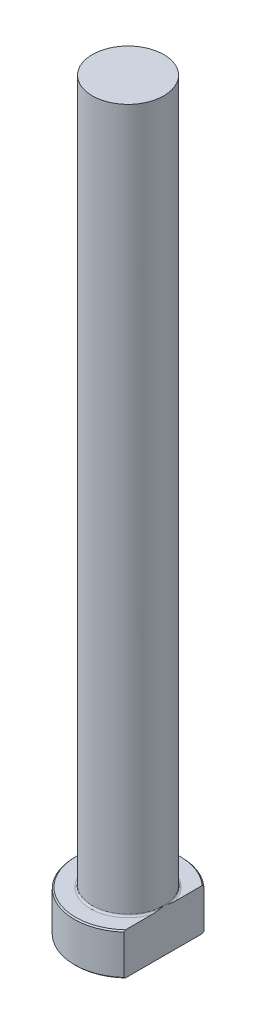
ISO-10303-21;
HEADER;
FILE_DESCRIPTION(('STEP AP214'),'2;1');
FILE_NAME('part.step','',(''),(''),'','','');
FILE_SCHEMA(('AUTOMOTIVE_DESIGN { 1 0 10303 214 1 1 1 1 }'));
ENDSEC;
DATA;
#1=APPLICATION_CONTEXT('core data for automotive mechanical design processes');
#2=APPLICATION_PROTOCOL_DEFINITION('international standard','automotive_design',2000,#1);
#3=PRODUCT_CONTEXT('',#1,'mechanical');
#4=PRODUCT('Part','Part','',(#3));
#5=PRODUCT_RELATED_PRODUCT_CATEGORY('part','',(#4));
#6=PRODUCT_DEFINITION_FORMATION('','',#4);
#7=PRODUCT_DEFINITION_CONTEXT('part definition',#1,'design');
#8=PRODUCT_DEFINITION('design','',#6,#7);
#9=PRODUCT_DEFINITION_SHAPE('','',#8);
#10=(LENGTH_UNIT() NAMED_UNIT(*) SI_UNIT(.MILLI.,.METRE.));
#11=(NAMED_UNIT(*) PLANE_ANGLE_UNIT() SI_UNIT($,.RADIAN.));
#12=(NAMED_UNIT(*) SI_UNIT($,.STERADIAN.) SOLID_ANGLE_UNIT());
#13=UNCERTAINTY_MEASURE_WITH_UNIT(LENGTH_MEASURE(1.E-05),#10,'distance_accuracy_value','');
#14=(GEOMETRIC_REPRESENTATION_CONTEXT(3) GLOBAL_UNCERTAINTY_ASSIGNED_CONTEXT((#13)) GLOBAL_UNIT_ASSIGNED_CONTEXT((#10,
#11,#12)) REPRESENTATION_CONTEXT('',''));
#15=CARTESIAN_POINT('',(0.,0.,0.));
#16=DIRECTION('',(0.,0.,1.));
#17=DIRECTION('',(1.,0.,0.));
#18=AXIS2_PLACEMENT_3D('',#15,#16,#17);
#19=CARTESIAN_POINT('',(0.,0.,0.));
#20=DIRECTION('',(0.,-1.,0.));
#21=DIRECTION('',(0.,0.,-1.));
#22=AXIS2_PLACEMENT_3D('',#19,#20,#21);
#23=PLANE('',#22);
#24=CARTESIAN_POINT('',(0.,0.,0.));
#25=DIRECTION('',(0.,-1.,0.));
#26=DIRECTION('',(0.,0.,-1.));
#27=AXIS2_PLACEMENT_3D('',#24,#25,#26);
#28=CIRCLE('',#27,8.79999999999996);
#29=CARTESIAN_POINT('',(5.99999999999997,0.,6.4373907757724));
#30=VERTEX_POINT('',#29);
#31=CARTESIAN_POINT('',(5.99999999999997,0.,-6.4373907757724));
#32=VERTEX_POINT('',#31);
#33=EDGE_CURVE('E98',#30,#32,#28,.T.);
#34=ORIENTED_EDGE('',*,*,#33,.T.);
#35=DIRECTION('',(0.,0.,1.));
#36=VECTOR('',#35,1.);
#37=CARTESIAN_POINT('',(5.99999999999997,0.,-6.70820393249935));
#38=LINE('',#37,#36);
#39=EDGE_CURVE('E83',#32,#30,#38,.T.);
#40=ORIENTED_EDGE('',*,*,#39,.T.);
#41=EDGE_LOOP('',(#34,#40));
#42=FACE_BOUND('',#41,.T.);
#43=ADVANCED_FACE('F32',(#42),#23,.T.);
#44=CARTESIAN_POINT('',(0.,259.958771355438,0.));
#45=DIRECTION('',(0.,1.,0.));
#46=DIRECTION('',(0.,0.,1.));
#47=AXIS2_PLACEMENT_3D('',#44,#45,#46);
#48=CYLINDRICAL_SURFACE('',#47,8.99999999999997);
#49=CARTESIAN_POINT('',(0.,6.79999999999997,0.));
#50=DIRECTION('',(0.,1.,0.));
#51=DIRECTION('',(0.,0.,1.));
#52=AXIS2_PLACEMENT_3D('',#49,#50,#51);
#53=CIRCLE('',#52,8.99999999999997);
#54=CARTESIAN_POINT('',(5.99999999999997,6.79999999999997,6.70820393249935));
#55=VERTEX_POINT('',#54);
#56=CARTESIAN_POINT('',(5.99999999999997,6.79999999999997,-6.70820393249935));
#57=VERTEX_POINT('',#56);
#58=EDGE_CURVE('E104',#55,#57,#53,.F.);
#59=ORIENTED_EDGE('',*,*,#58,.T.);
#60=DIRECTION('',(0.,-1.,0.));
#61=VECTOR('',#60,1.);
#62=CARTESIAN_POINT('',(5.99999999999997,125.,-6.70820393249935));
#63=LINE('',#62,#61);
#64=CARTESIAN_POINT('',(5.99999999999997,0.199999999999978,-6.70820393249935));
#65=VERTEX_POINT('',#64);
#66=EDGE_CURVE('E183',#57,#65,#63,.T.);
#67=ORIENTED_EDGE('',*,*,#66,.T.);
#68=CARTESIAN_POINT('',(0.,0.199999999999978,0.));
#69=DIRECTION('',(0.,-1.,0.));
#70=DIRECTION('',(0.,0.,-1.));
#71=AXIS2_PLACEMENT_3D('',#68,#69,#70);
#72=CIRCLE('',#71,8.99999999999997);
#73=CARTESIAN_POINT('',(5.99999999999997,0.199999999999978,6.70820393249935));
#74=VERTEX_POINT('',#73);
#75=EDGE_CURVE('E100',#65,#74,#72,.F.);
#76=ORIENTED_EDGE('',*,*,#75,.T.);
#77=DIRECTION('',(0.,-1.,0.));
#78=VECTOR('',#77,1.);
#79=CARTESIAN_POINT('',(5.99999999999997,125.,6.70820393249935));
#80=LINE('',#79,#78);
#81=EDGE_CURVE('E93',#55,#74,#80,.T.);
#82=ORIENTED_EDGE('',*,*,#81,.F.);
#83=EDGE_LOOP('',(#59,#67,#76,#82));
#84=FACE_BOUND('',#83,.T.);
#85=ADVANCED_FACE('F158',(#84),#48,.T.);
#86=CARTESIAN_POINT('',(-8.99999999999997,7.,0.));
#87=DIRECTION('',(0.,1.,0.));
#88=DIRECTION('',(0.,0.,1.));
#89=AXIS2_PLACEMENT_3D('',#86,#87,#88);
#90=PLANE('',#89);
#91=CARTESIAN_POINT('',(0.,7.,0.));
#92=DIRECTION('',(0.,1.,0.));
#93=DIRECTION('',(0.,0.,1.));
#94=AXIS2_PLACEMENT_3D('',#91,#92,#93);
#95=CIRCLE('',#94,8.79999999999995);
#96=CARTESIAN_POINT('',(5.99999999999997,7.,-6.4373907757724));
#97=VERTEX_POINT('',#96);
#98=CARTESIAN_POINT('',(5.99999999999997,7.,6.4373907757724));
#99=VERTEX_POINT('',#98);
#100=EDGE_CURVE('E178',#97,#99,#95,.T.);
#101=ORIENTED_EDGE('',*,*,#100,.T.);
#102=DIRECTION('',(0.,0.,-1.));
#103=VECTOR('',#102,1.);
#104=CARTESIAN_POINT('',(5.99999999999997,7.,0.));
#105=LINE('',#104,#103);
#106=CARTESIAN_POINT('',(5.99999999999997,6.99999999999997,1.92093727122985));
#107=VERTEX_POINT('',#106);
#108=EDGE_CURVE('E57',#99,#107,#105,.T.);
#109=ORIENTED_EDGE('',*,*,#108,.T.);
#110=CARTESIAN_POINT('',(0.,7.,0.));
#111=DIRECTION('',(0.,1.,0.));
#112=DIRECTION('',(0.,0.,1.));
#113=AXIS2_PLACEMENT_3D('',#110,#111,#112);
#114=CIRCLE('',#113,6.29999999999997);
#115=CARTESIAN_POINT('',(5.99999999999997,6.99999999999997,-1.92093727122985));
#116=VERTEX_POINT('',#115);
#117=EDGE_CURVE('E107',#107,#116,#114,.F.);
#118=ORIENTED_EDGE('',*,*,#117,.T.);
#119=EDGE_CURVE('E136',#116,#97,#105,.T.);
#120=ORIENTED_EDGE('',*,*,#119,.T.);
#121=EDGE_LOOP('',(#101,#109,#118,#120));
#122=FACE_BOUND('',#121,.T.);
#123=ADVANCED_FACE('F147',(#122),#90,.T.);
#124=CARTESIAN_POINT('',(0.,7.00000000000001,0.));
#125=DIRECTION('',(0.,-1.,0.));
#126=DIRECTION('',(0.,0.,-1.));
#127=AXIS2_PLACEMENT_3D('',#124,#125,#126);
#128=CONICAL_SURFACE('',#127,8.79999999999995,0.785398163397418);
#129=ORIENTED_EDGE('',*,*,#58,.F.);
#130=CARTESIAN_POINT('',(5.99999999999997,-0.132115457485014,14.7591430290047));
#131=CARTESIAN_POINT('',(5.99999999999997,0.0733919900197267,14.537299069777));
#132=CARTESIAN_POINT('',(5.99999999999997,0.278550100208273,14.315131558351));
#133=CARTESIAN_POINT('',(5.99999999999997,0.688060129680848,13.8700519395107));
#134=CARTESIAN_POINT('',(5.99999999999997,0.892412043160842,13.6471398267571));
#135=CARTESIAN_POINT('',(5.99999999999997,1.50418032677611,12.9770492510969));
#136=CARTESIAN_POINT('',(5.99999999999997,1.91022091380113,12.528611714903));
#137=CARTESIAN_POINT('',(5.99999999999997,2.71980134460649,11.6246427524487));
#138=CARTESIAN_POINT('',(5.99999999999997,3.12331180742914,11.1690849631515));
#139=CARTESIAN_POINT('',(5.99999999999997,3.92341525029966,10.2520077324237));
#140=CARTESIAN_POINT('',(5.99999999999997,4.32000903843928,9.79048899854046));
#141=CARTESIAN_POINT('',(5.99999999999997,5.02478816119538,8.95241885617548));
#142=CARTESIAN_POINT('',(5.99999999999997,5.33476112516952,8.57737771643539));
#143=CARTESIAN_POINT('',(5.99999999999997,5.79310598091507,8.00939108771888));
#144=CARTESIAN_POINT('',(5.99999999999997,5.9448056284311,7.81913145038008));
#145=CARTESIAN_POINT('',(5.99999999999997,6.24553651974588,7.43651727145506));
#146=CARTESIAN_POINT('',(5.99999999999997,6.39456781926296,7.24416277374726));
#147=CARTESIAN_POINT('',(5.99999999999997,6.68925367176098,6.85721540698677));
#148=CARTESIAN_POINT('',(5.99999999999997,6.83491177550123,6.66262524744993));
#149=CARTESIAN_POINT('',(5.99999999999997,7.12230719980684,6.27057707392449));
#150=CARTESIAN_POINT('',(5.99999999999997,7.26404470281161,6.07311919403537));
#151=CARTESIAN_POINT('',(5.99999999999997,7.54263362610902,5.6748871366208));
#152=CARTESIAN_POINT('',(5.99999999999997,7.67948689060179,5.47411425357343));
#153=CARTESIAN_POINT('',(5.99999999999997,7.94714213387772,5.06858845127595));
#154=CARTESIAN_POINT('',(5.99999999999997,8.07794479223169,4.86383598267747));
#155=CARTESIAN_POINT('',(5.99999999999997,8.32827993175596,4.45554322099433));
#156=CARTESIAN_POINT('',(5.99999999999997,8.448027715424,4.25213564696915));
#157=CARTESIAN_POINT('',(5.99999999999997,8.67837972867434,3.84013730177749));
#158=CARTESIAN_POINT('',(5.99999999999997,8.78898293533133,3.63154595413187));
#159=CARTESIAN_POINT('',(5.99999999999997,8.99840984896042,3.20863811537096));
#160=CARTESIAN_POINT('',(5.99999999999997,9.09724073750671,2.99432521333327));
#161=CARTESIAN_POINT('',(5.99999999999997,9.2799177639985,2.55937061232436));
#162=CARTESIAN_POINT('',(5.99999999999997,9.36376811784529,2.33873071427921));
#163=CARTESIAN_POINT('',(5.99999999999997,9.49627737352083,1.94012294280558));
#164=CARTESIAN_POINT('',(5.99999999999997,9.5486217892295,1.76338731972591));
#165=CARTESIAN_POINT('',(5.99999999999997,9.639780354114,1.40643307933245));
#166=CARTESIAN_POINT('',(5.99999999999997,9.67859618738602,1.22621489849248));
#167=CARTESIAN_POINT('',(5.99999999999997,9.74077317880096,0.863704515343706));
#168=CARTESIAN_POINT('',(5.99999999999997,9.76418479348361,0.681421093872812));
#169=CARTESIAN_POINT('',(5.99999999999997,9.79447814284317,0.315473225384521));
#170=CARTESIAN_POINT('',(5.99999999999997,9.80136083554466,0.131808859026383));
#171=CARTESIAN_POINT('',(5.99999999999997,9.79818788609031,-0.235881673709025));
#172=CARTESIAN_POINT('',(5.99999999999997,9.78808514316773,-0.419907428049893));
#173=CARTESIAN_POINT('',(5.99999999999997,9.75144464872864,-0.786302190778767));
#174=CARTESIAN_POINT('',(5.99999999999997,9.72490559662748,-0.968671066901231));
#175=CARTESIAN_POINT('',(5.99999999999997,9.65670736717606,-1.33110767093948));
#176=CARTESIAN_POINT('',(5.99999999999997,9.61500120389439,-1.51116642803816));
#177=CARTESIAN_POINT('',(5.99999999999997,9.51838325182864,-1.86766519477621));
#178=CARTESIAN_POINT('',(5.99999999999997,9.46347085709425,-2.04410503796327));
#179=CARTESIAN_POINT('',(5.99999999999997,9.33563659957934,-2.41270922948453));
#180=CARTESIAN_POINT('',(5.99999999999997,9.26138327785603,-2.60440790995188));
#181=CARTESIAN_POINT('',(5.99999999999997,9.10155310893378,-2.98306496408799));
#182=CARTESIAN_POINT('',(5.99999999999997,9.01597146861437,-3.17002129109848));
#183=CARTESIAN_POINT('',(5.99999999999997,8.83553473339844,-3.53975380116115));
#184=CARTESIAN_POINT('',(5.99999999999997,8.74066449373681,-3.72252253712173));
#185=CARTESIAN_POINT('',(5.99999999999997,8.5435547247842,-4.08398624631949));
#186=CARTESIAN_POINT('',(5.99999999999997,8.44131612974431,-4.26268173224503));
#187=CARTESIAN_POINT('',(5.99999999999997,8.22953960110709,-4.61872309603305));
#188=CARTESIAN_POINT('',(5.99999999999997,8.11992610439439,-4.79602381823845));
#189=CARTESIAN_POINT('',(5.99999999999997,7.89571048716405,-5.14743548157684));
#190=CARTESIAN_POINT('',(5.99999999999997,7.78110825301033,-5.32154634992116));
#191=CARTESIAN_POINT('',(5.99999999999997,7.54792782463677,-5.66682327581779));
#192=CARTESIAN_POINT('',(5.99999999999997,7.42935372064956,-5.83799210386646));
#193=CARTESIAN_POINT('',(5.99999999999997,7.18881616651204,-6.17793707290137));
#194=CARTESIAN_POINT('',(5.99999999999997,7.06685256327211,-6.34671310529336));
#195=CARTESIAN_POINT('',(5.99999999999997,6.8053977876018,-6.70216781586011));
#196=CARTESIAN_POINT('',(5.99999999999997,6.66554966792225,-6.88858356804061));
#197=CARTESIAN_POINT('',(5.99999999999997,6.38292065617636,-7.25918139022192));
#198=CARTESIAN_POINT('',(5.99999999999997,6.24013967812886,-7.44336339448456));
#199=CARTESIAN_POINT('',(5.99999999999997,5.80812002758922,-7.99307414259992));
#200=CARTESIAN_POINT('',(5.99999999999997,5.51523002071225,-8.35573349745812));
#201=CARTESIAN_POINT('',(5.99999999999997,4.92224619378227,-9.07562940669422));
#202=CARTESIAN_POINT('',(5.99999999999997,4.62214609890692,-9.43286076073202));
#203=CARTESIAN_POINT('',(5.99999999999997,4.0167738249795,-10.1429201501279));
#204=CARTESIAN_POINT('',(5.99999999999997,3.71150152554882,-10.4957480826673));
#205=CARTESIAN_POINT('',(5.99999999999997,3.11456796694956,-11.1779164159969));
#206=CARTESIAN_POINT('',(5.99999999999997,2.82312451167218,-11.5074478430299));
#207=CARTESIAN_POINT('',(5.99999999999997,2.23747184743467,-12.1640528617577));
#208=CARTESIAN_POINT('',(5.99999999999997,1.94326258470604,-12.4911264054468));
#209=CARTESIAN_POINT('',(5.99999999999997,1.35320776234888,-13.1426363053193));
#210=CARTESIAN_POINT('',(5.99999999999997,1.05736649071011,-13.4670765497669));
#211=CARTESIAN_POINT('',(5.99999999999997,0.463882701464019,-14.1142803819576));
#212=CARTESIAN_POINT('',(5.99999999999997,0.166240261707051,-14.4370440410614));
#213=CARTESIAN_POINT('',(5.99999999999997,-0.132115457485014,-14.7591430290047));
#214=B_SPLINE_CURVE_WITH_KNOTS('',3,(#130,#131,#132,#133,#134,#135,#136,#137,#138,#139,#140,
#141,#142,#143,#144,#145,#146,#147,#148,#149,#150,#151,#152,#153,#154,#155,#156,#157,#158,#159,
#160,#161,#162,#163,#164,#165,#166,#167,#168,#169,#170,#171,#172,#173,#174,#175,#176,#177,#178,
#179,#180,#181,#182,#183,#184,#185,#186,#187,#188,#189,#190,#191,#192,#193,#194,#195,#196,#197,
#198,#199,#200,#201,#202,#203,#204,#205,#206,#207,#208,#209,#210,#211,#212,#213),.UNSPECIFIED.,
.F.,.F.,(4,2,2,2,2,2,2,2,2,2,2,2,2,2,2,2,2,2,2,2,2,2,2,2,2,2,2,2,2,2,2,2,2,2,2,2,2,2,2,2,2,4),
(0.,0.907210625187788,1.81442776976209,3.62925156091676,5.4549048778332,7.28034345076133,
8.73990838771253,9.46989218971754,10.1998607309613,10.9290223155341,11.6581499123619,
12.3869992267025,13.1157664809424,13.82369738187,14.5317073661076,15.2392832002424,
15.9466595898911,16.4991819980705,17.0516356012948,17.6022705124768,18.1528735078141,
18.7050058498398,19.2571818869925,19.8110832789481,20.365010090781,20.9812908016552,
21.5978331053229,22.2153979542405,22.8328846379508,23.4581285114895,24.083386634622,
24.7080195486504,25.3326807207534,26.0317691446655,26.7308780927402,28.1292235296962,
29.5288334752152,30.9284760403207,32.2482200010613,33.5679896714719,34.8851960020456,
36.2023458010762),.UNSPECIFIED.);
#215=EDGE_CURVE('E135',#55,#99,#214,.T.);
#216=ORIENTED_EDGE('',*,*,#215,.T.);
#217=ORIENTED_EDGE('',*,*,#100,.F.);
#218=EDGE_CURVE('E127',#97,#57,#214,.T.);
#219=ORIENTED_EDGE('',*,*,#218,.T.);
#220=EDGE_LOOP('',(#129,#216,#217,#219));
#221=FACE_BOUND('',#220,.T.);
#222=ADVANCED_FACE('F143',(#221),#128,.T.);
#223=CARTESIAN_POINT('',(0.,0.199999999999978,0.));
#224=DIRECTION('',(0.,1.,0.));
#225=DIRECTION('',(0.,0.,1.));
#226=AXIS2_PLACEMENT_3D('',#223,#224,#225);
#227=CONICAL_SURFACE('',#226,8.99999999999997,0.785398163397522);
#228=ORIENTED_EDGE('',*,*,#75,.F.);
#229=CARTESIAN_POINT('',(5.99999999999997,7.13211545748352,-14.7591430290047));
#230=CARTESIAN_POINT('',(5.99999999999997,6.9266080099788,-14.537299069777));
#231=CARTESIAN_POINT('',(5.99999999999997,6.72144989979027,-14.3151315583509));
#232=CARTESIAN_POINT('',(5.99999999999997,6.31193987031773,-13.8700519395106));
#233=CARTESIAN_POINT('',(5.99999999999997,6.10758795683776,-13.647139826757));
#234=CARTESIAN_POINT('',(5.99999999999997,5.49581967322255,-12.9770492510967));
#235=CARTESIAN_POINT('',(5.99999999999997,5.08977908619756,-12.5286117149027));
#236=CARTESIAN_POINT('',(5.99999999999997,4.28019865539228,-11.6246427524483));
#237=CARTESIAN_POINT('',(5.99999999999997,3.87668819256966,-11.1690849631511));
#238=CARTESIAN_POINT('',(5.99999999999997,3.0765847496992,-10.2520077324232));
#239=CARTESIAN_POINT('',(5.99999999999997,2.67999096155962,-9.79048899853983));
#240=CARTESIAN_POINT('',(5.99999999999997,1.97521183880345,-8.95241885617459));
#241=CARTESIAN_POINT('',(5.99999999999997,1.66523887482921,-8.5773777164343));
#242=CARTESIAN_POINT('',(5.99999999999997,1.20689401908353,-8.00939108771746));
#243=CARTESIAN_POINT('',(5.99999999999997,1.05519437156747,-7.81913145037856));
#244=CARTESIAN_POINT('',(5.99999999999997,0.754463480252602,-7.43651727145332));
#245=CARTESIAN_POINT('',(5.99999999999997,0.605432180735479,-7.2441627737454));
#246=CARTESIAN_POINT('',(5.99999999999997,0.310746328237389,-6.8572154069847));
#247=CARTESIAN_POINT('',(5.99999999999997,0.1650882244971,-6.66262524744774));
#248=CARTESIAN_POINT('',(5.99999999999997,-0.122307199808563,-6.27057707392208));
#249=CARTESIAN_POINT('',(5.99999999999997,-0.264044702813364,-6.07311919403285));
#250=CARTESIAN_POINT('',(5.99999999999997,-0.542633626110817,-5.67488713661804));
#251=CARTESIAN_POINT('',(5.99999999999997,-0.679486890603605,-5.47411425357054));
#252=CARTESIAN_POINT('',(5.99999999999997,-0.947142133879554,-5.06858845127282));
#253=CARTESIAN_POINT('',(5.99999999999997,-1.07794479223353,-4.86383598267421));
#254=CARTESIAN_POINT('',(5.99999999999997,-1.32827993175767,-4.45554322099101));
#255=CARTESIAN_POINT('',(5.99999999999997,-1.44802771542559,-4.25213564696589));
#256=CARTESIAN_POINT('',(5.99999999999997,-1.67837972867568,-3.84013730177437));
#257=CARTESIAN_POINT('',(5.99999999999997,-1.78898293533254,-3.63154595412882));
#258=CARTESIAN_POINT('',(5.99999999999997,-1.99840984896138,-3.20863811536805));
#259=CARTESIAN_POINT('',(5.99999999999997,-2.09724073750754,-2.99432521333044));
#260=CARTESIAN_POINT('',(5.99999999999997,-2.27991776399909,-2.55937061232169));
#261=CARTESIAN_POINT('',(5.99999999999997,-2.36376811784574,-2.33873071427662));
#262=CARTESIAN_POINT('',(5.99999999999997,-2.4962773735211,-1.94012294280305));
#263=CARTESIAN_POINT('',(5.99999999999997,-2.5486217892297,-1.76338731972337));
#264=CARTESIAN_POINT('',(5.99999999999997,-2.63978035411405,-1.40643307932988));
#265=CARTESIAN_POINT('',(5.99999999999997,-2.67859618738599,-1.2262148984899));
#266=CARTESIAN_POINT('',(5.99999999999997,-2.74077317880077,-0.863704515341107));
#267=CARTESIAN_POINT('',(5.99999999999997,-2.76418479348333,-0.681421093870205));
#268=CARTESIAN_POINT('',(5.99999999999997,-2.79447814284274,-0.315473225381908));
#269=CARTESIAN_POINT('',(5.99999999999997,-2.80136083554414,-0.131808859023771));
#270=CARTESIAN_POINT('',(5.99999999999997,-2.79818788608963,0.235881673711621));
#271=CARTESIAN_POINT('',(5.99999999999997,-2.78808514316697,0.419907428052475));
#272=CARTESIAN_POINT('',(5.99999999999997,-2.75144464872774,0.786302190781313));
#273=CARTESIAN_POINT('',(5.99999999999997,-2.72490559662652,0.968671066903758));
#274=CARTESIAN_POINT('',(5.99999999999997,-2.65670736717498,1.33110767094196));
#275=CARTESIAN_POINT('',(5.99999999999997,-2.61500120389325,1.51116642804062));
#276=CARTESIAN_POINT('',(5.99999999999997,-2.51838325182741,1.86766519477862));
#277=CARTESIAN_POINT('',(5.99999999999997,-2.46347085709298,2.04410503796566));
#278=CARTESIAN_POINT('',(5.99999999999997,-2.33563659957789,2.41270922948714));
#279=CARTESIAN_POINT('',(5.99999999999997,-2.26138327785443,2.60440790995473));
#280=CARTESIAN_POINT('',(5.99999999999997,-2.10155310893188,2.98306496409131));
#281=CARTESIAN_POINT('',(5.99999999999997,-2.0159714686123,3.17002129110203));
#282=CARTESIAN_POINT('',(5.99999999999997,-1.83553473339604,3.53975380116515));
#283=CARTESIAN_POINT('',(5.99999999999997,-1.74066449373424,3.72252253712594));
#284=CARTESIAN_POINT('',(5.99999999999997,-1.54355472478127,4.08398624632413));
#285=CARTESIAN_POINT('',(5.99999999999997,-1.4413161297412,4.26268173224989));
#286=CARTESIAN_POINT('',(5.99999999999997,-1.22953960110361,4.61872309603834));
#287=CARTESIAN_POINT('',(5.99999999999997,-1.11992610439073,4.79602381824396));
#288=CARTESIAN_POINT('',(5.99999999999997,-0.89571048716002,5.14743548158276));
#289=CARTESIAN_POINT('',(5.99999999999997,-0.781108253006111,5.32154634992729));
#290=CARTESIAN_POINT('',(5.99999999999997,-0.547927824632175,5.66682327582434));
#291=CARTESIAN_POINT('',(5.99999999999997,-0.429353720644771,5.83799210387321));
#292=CARTESIAN_POINT('',(5.99999999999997,-0.188816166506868,6.17793707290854));
#293=CARTESIAN_POINT('',(5.99999999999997,-0.0668525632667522,6.34671310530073));
#294=CARTESIAN_POINT('',(5.99999999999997,0.194602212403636,6.70216781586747));
#295=CARTESIAN_POINT('',(5.99999999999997,0.334450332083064,6.88858356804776));
#296=CARTESIAN_POINT('',(5.99999999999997,0.617079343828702,7.25918139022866));
#297=CARTESIAN_POINT('',(5.99999999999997,0.759860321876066,7.4433633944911));
#298=CARTESIAN_POINT('',(5.99999999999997,1.19187997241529,7.99307414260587));
#299=CARTESIAN_POINT('',(5.99999999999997,1.48476997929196,8.35573349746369));
#300=CARTESIAN_POINT('',(5.99999999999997,2.07775380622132,9.07562940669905));
#301=CARTESIAN_POINT('',(5.99999999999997,2.37785390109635,9.43286076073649));
#302=CARTESIAN_POINT('',(5.99999999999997,2.98322617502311,10.1429201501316));
#303=CARTESIAN_POINT('',(5.99999999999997,3.28849847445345,10.4957480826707));
#304=CARTESIAN_POINT('',(5.99999999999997,3.8854320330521,11.1779164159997));
#305=CARTESIAN_POINT('',(5.99999999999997,4.1768754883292,11.5074478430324));
#306=CARTESIAN_POINT('',(5.99999999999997,4.76252815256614,12.1640528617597));
#307=CARTESIAN_POINT('',(5.99999999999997,5.05673741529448,12.4911264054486));
#308=CARTESIAN_POINT('',(5.99999999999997,5.64679223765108,13.1426363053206));
#309=CARTESIAN_POINT('',(5.99999999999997,5.94263350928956,13.4670765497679));
#310=CARTESIAN_POINT('',(5.99999999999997,6.53611729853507,14.1142803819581));
#311=CARTESIAN_POINT('',(5.99999999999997,6.83375973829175,14.4370440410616));
#312=CARTESIAN_POINT('',(5.99999999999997,7.13211545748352,14.7591430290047));
#313=B_SPLINE_CURVE_WITH_KNOTS('',3,(#229,#230,#231,#232,#233,#234,#235,#236,#237,#238,#239,
#240,#241,#242,#243,#244,#245,#246,#247,#248,#249,#250,#251,#252,#253,#254,#255,#256,#257,#258,
#259,#260,#261,#262,#263,#264,#265,#266,#267,#268,#269,#270,#271,#272,#273,#274,#275,#276,#277,
#278,#279,#280,#281,#282,#283,#284,#285,#286,#287,#288,#289,#290,#291,#292,#293,#294,#295,#296,
#297,#298,#299,#300,#301,#302,#303,#304,#305,#306,#307,#308,#309,#310,#311,#312),.UNSPECIFIED.,
.F.,.F.,(4,2,2,2,2,2,2,2,2,2,2,2,2,2,2,2,2,2,2,2,2,2,2,2,2,2,2,2,2,2,2,2,2,2,2,2,2,2,2,2,2,4),
(0.,0.907210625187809,1.81442776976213,3.62925156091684,5.45490487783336,7.28034345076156,
8.73990838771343,9.46989218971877,10.1998607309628,10.929022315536,11.6581499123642,
12.3869992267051,13.1157664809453,13.8236973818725,14.5317073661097,15.2392832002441,
15.9466595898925,16.4991819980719,17.0516356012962,17.6022705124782,18.1528735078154,
18.7050058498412,19.2571818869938,19.8110832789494,20.3650100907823,20.9812908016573,
21.5978331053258,22.2153979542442,22.8328846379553,23.4581285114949,24.0833866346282,
24.7080195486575,25.3326807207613,26.0317691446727,26.7308780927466,28.1292235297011,
29.5288334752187,30.9284760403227,32.2482200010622,33.5679896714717,34.8851960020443,
36.2023458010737),.UNSPECIFIED.);
#314=EDGE_CURVE('E86',#65,#32,#313,.T.);
#315=ORIENTED_EDGE('',*,*,#314,.T.);
#316=ORIENTED_EDGE('',*,*,#33,.F.);
#317=EDGE_CURVE('E89',#30,#74,#313,.T.);
#318=ORIENTED_EDGE('',*,*,#317,.T.);
#319=EDGE_LOOP('',(#228,#315,#316,#318));
#320=FACE_BOUND('',#319,.T.);
#321=ADVANCED_FACE('F97',(#320),#227,.T.);
#322=CARTESIAN_POINT('',(0.,7.29999999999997,0.));
#323=DIRECTION('',(0.,1.,0.));
#324=DIRECTION('',(0.,0.,1.));
#325=AXIS2_PLACEMENT_3D('',#322,#323,#324);
#326=TOROIDAL_SURFACE('',#325,6.29999999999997,0.3);
#327=CARTESIAN_POINT('',(5.99999999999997,7.29999999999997,0.));
#328=CARTESIAN_POINT('',(5.99999999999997,7.30000062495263,1.34604287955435E-10));
#329=CARTESIAN_POINT('',(5.99999999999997,7.30000124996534,-2.85495107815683E-07));
#330=CARTESIAN_POINT('',(5.99999999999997,7.30000241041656,-1.04928090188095E-06));
#331=CARTESIAN_POINT('',(5.99999999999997,7.30000292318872,-1.54785170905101E-06));
#332=CARTESIAN_POINT('',(5.99999999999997,7.30000401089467,-2.74944383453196E-06));
#333=CARTESIAN_POINT('',(5.99999999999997,7.30000456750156,-3.47196539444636E-06));
#334=CARTESIAN_POINT('',(5.99999999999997,7.30000554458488,-4.95172582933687E-06));
#335=CARTESIAN_POINT('',(5.99999999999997,7.30000596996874,-5.70604365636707E-06));
#336=CARTESIAN_POINT('',(5.99999999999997,7.30000759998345,-8.69525109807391E-06));
#337=CARTESIAN_POINT('',(5.99999999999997,7.30000872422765,-1.0978182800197E-05));
#338=CARTESIAN_POINT('',(5.99999999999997,7.30001052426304,-1.54456346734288E-05));
#339=CARTESIAN_POINT('',(5.99999999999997,7.3000112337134,-1.76170762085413E-05));
#340=CARTESIAN_POINT('',(5.99999999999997,7.30001429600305,-2.69928123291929E-05));
#341=CARTESIAN_POINT('',(5.99999999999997,7.30001664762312,-3.42000265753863E-05));
#342=CARTESIAN_POINT('',(5.99999999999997,7.30002002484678,-4.76829001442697E-05));
#343=CARTESIAN_POINT('',(5.99999999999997,7.30002120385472,-5.39195609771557E-05));
#344=CARTESIAN_POINT('',(5.99999999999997,7.30002992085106,-0.000100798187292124));
#345=CARTESIAN_POINT('',(5.99999999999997,7.30003667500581,-0.00014152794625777));
#346=CARTESIAN_POINT('',(5.99999999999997,7.30006623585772,-0.000303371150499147));
#347=CARTESIAN_POINT('',(5.99999999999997,7.30009428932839,-0.000423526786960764));
#348=CARTESIAN_POINT('',(5.99999999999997,7.30020425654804,-0.000901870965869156));
#349=CARTESIAN_POINT('',(5.99999999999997,7.3002828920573,-0.00126055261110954));
#350=CARTESIAN_POINT('',(5.99999999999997,7.30059934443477,-0.0026940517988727));
#351=CARTESIAN_POINT('',(5.99999999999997,7.3008413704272,-0.0037682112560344));
#352=CARTESIAN_POINT('',(5.99999999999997,7.30185255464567,-0.0082672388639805));
#353=CARTESIAN_POINT('',(5.99999999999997,7.30261638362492,-0.0116929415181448));
#354=CARTESIAN_POINT('',(5.99999999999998,7.30945824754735,-0.0423635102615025));
#355=CARTESIAN_POINT('',(5.99999999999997,7.31555811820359,-0.0696050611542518));
#356=CARTESIAN_POINT('',(5.99999999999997,7.32747716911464,-0.122985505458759));
#357=CARTESIAN_POINT('',(5.99999999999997,7.33329766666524,-0.149124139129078));
#358=CARTESIAN_POINT('',(5.99999999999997,7.34565922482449,-0.204790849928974));
#359=CARTESIAN_POINT('',(5.99999999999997,7.352196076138,-0.234319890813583));
#360=CARTESIAN_POINT('',(5.99999999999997,7.36527652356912,-0.29372170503));
#361=CARTESIAN_POINT('',(5.99999999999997,7.37181938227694,-0.323594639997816));
#362=CARTESIAN_POINT('',(5.99999999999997,7.38741819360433,-0.395325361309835));
#363=CARTESIAN_POINT('',(5.99999999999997,7.39643140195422,-0.437192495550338));
#364=CARTESIAN_POINT('',(5.99999999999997,7.41397520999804,-0.519837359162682));
#365=CARTESIAN_POINT('',(5.99999999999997,7.4225122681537,-0.560613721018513));
#366=CARTESIAN_POINT('',(5.99999999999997,7.45005469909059,-0.694529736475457));
#367=CARTESIAN_POINT('',(5.99999999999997,7.46845270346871,-0.787796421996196));
#368=CARTESIAN_POINT('',(5.99999999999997,7.50309772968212,-0.975673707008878));
#369=CARTESIAN_POINT('',(5.99999999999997,7.51932210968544,-1.07028855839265));
#370=CARTESIAN_POINT('',(5.99999999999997,7.54979671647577,-1.26922112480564));
#371=CARTESIAN_POINT('',(5.99999999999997,7.56370439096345,-1.37359247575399));
#372=CARTESIAN_POINT('',(5.99999999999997,7.58567213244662,-1.58267692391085));
#373=CARTESIAN_POINT('',(5.99999999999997,7.59375049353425,-1.68738790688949));
#374=CARTESIAN_POINT('',(5.99999999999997,7.59943466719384,-1.8430899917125));
#375=CARTESIAN_POINT('',(5.99999999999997,7.60029184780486,-1.89396002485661));
#376=CARTESIAN_POINT('',(5.99999999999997,7.5995288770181,-1.99574511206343));
#377=CARTESIAN_POINT('',(5.99999999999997,7.59790613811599,-2.04666015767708));
#378=CARTESIAN_POINT('',(5.99999999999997,7.59158346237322,-2.14740525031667));
#379=CARTESIAN_POINT('',(5.99999999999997,7.58693864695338,-2.19723851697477));
#380=CARTESIAN_POINT('',(5.99999999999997,7.57369485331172,-2.29634018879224));
#381=CARTESIAN_POINT('',(5.99999999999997,7.56510170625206,-2.3456093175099));
#382=CARTESIAN_POINT('',(5.99999999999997,7.54513600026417,-2.43101613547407));
#383=CARTESIAN_POINT('',(5.99999999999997,7.53495732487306,-2.46741817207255));
#384=CARTESIAN_POINT('',(5.99999999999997,7.5163599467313,-2.52083307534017));
#385=CARTESIAN_POINT('',(5.99999999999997,7.50961541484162,-2.53842082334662));
#386=CARTESIAN_POINT('',(5.99999999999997,7.49476050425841,-2.57300282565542));
#387=CARTESIAN_POINT('',(5.99999999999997,7.48665036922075,-2.58999718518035));
#388=CARTESIAN_POINT('',(5.99999999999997,7.4656679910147,-2.62872971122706));
#389=CARTESIAN_POINT('',(5.99999999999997,7.45211281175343,-2.65012863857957));
#390=CARTESIAN_POINT('',(5.99999999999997,7.42848584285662,-2.67978235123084));
#391=CARTESIAN_POINT('',(5.99999999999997,7.42001211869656,-2.68929941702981));
#392=CARTESIAN_POINT('',(5.99999999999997,7.40175979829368,-2.70700164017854));
#393=CARTESIAN_POINT('',(5.99999999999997,7.39198420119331,-2.71518976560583));
#394=CARTESIAN_POINT('',(5.99999999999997,7.37475773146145,-2.7269570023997));
#395=CARTESIAN_POINT('',(5.99999999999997,7.36772137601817,-2.73113834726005));
#396=CARTESIAN_POINT('',(5.99999999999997,7.35309194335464,-2.73838811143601));
#397=CARTESIAN_POINT('',(5.99999999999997,7.34549938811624,-2.7414575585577));
#398=CARTESIAN_POINT('',(5.99999999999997,7.32979919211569,-2.74623687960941));
#399=CARTESIAN_POINT('',(5.99999999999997,7.32168697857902,-2.74793213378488));
#400=CARTESIAN_POINT('',(5.99999999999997,7.30528814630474,-2.74970225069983));
#401=CARTESIAN_POINT('',(5.99999999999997,7.29700168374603,-2.74977850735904));
#402=CARTESIAN_POINT('',(5.99999999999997,7.2816016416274,-2.74839814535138));
#403=CARTESIAN_POINT('',(5.99999999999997,7.27447007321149,-2.74713049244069));
#404=CARTESIAN_POINT('',(5.99999999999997,7.26050316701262,-2.74347158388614));
#405=CARTESIAN_POINT('',(5.99999999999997,7.25366802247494,-2.7410796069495));
#406=CARTESIAN_POINT('',(5.99999999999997,7.23783277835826,-2.73423902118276));
#407=CARTESIAN_POINT('',(5.99999999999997,7.22902314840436,-2.72935244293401));
#408=CARTESIAN_POINT('',(5.99999999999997,7.21228574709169,-2.7182516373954));
#409=CARTESIAN_POINT('',(5.99999999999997,7.20436026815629,-2.71203407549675));
#410=CARTESIAN_POINT('',(5.99999999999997,7.18433696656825,-2.69420240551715));
#411=CARTESIAN_POINT('',(5.99999999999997,7.17298706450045,-2.68175715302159));
#412=CARTESIAN_POINT('',(5.99999999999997,7.15219498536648,-2.65539556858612));
#413=CARTESIAN_POINT('',(5.99999999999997,7.14275658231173,-2.64147640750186));
#414=CARTESIAN_POINT('',(5.99999999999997,7.12508934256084,-2.61223187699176));
#415=CARTESIAN_POINT('',(5.99999999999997,7.11691464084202,-2.59687428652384));
#416=CARTESIAN_POINT('',(5.99999999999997,7.10186133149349,-2.56552911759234));
#417=CARTESIAN_POINT('',(5.99999999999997,7.09498416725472,-2.54954086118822));
#418=CARTESIAN_POINT('',(5.99999999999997,7.07586257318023,-2.50075322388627));
#419=CARTESIAN_POINT('',(5.99999999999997,7.06523495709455,-2.46732486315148));
#420=CARTESIAN_POINT('',(5.99999999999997,7.04175411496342,-2.38014114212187));
#421=CARTESIAN_POINT('',(5.99999999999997,7.0311656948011,-2.32580591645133));
#422=CARTESIAN_POINT('',(5.99999999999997,7.01502027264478,-2.21628778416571));
#423=CARTESIAN_POINT('',(5.99999999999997,7.00947977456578,-2.16110269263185));
#424=CARTESIAN_POINT('',(5.99999999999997,7.00227593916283,-2.05225433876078));
#425=CARTESIAN_POINT('',(5.99999999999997,7.00049528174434,-1.99859827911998));
#426=CARTESIAN_POINT('',(5.99999999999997,6.99968738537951,-1.89155586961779));
#427=CARTESIAN_POINT('',(5.99999999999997,7.00064591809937,-1.83816956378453));
#428=CARTESIAN_POINT('',(5.99999999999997,7.00516082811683,-1.72092619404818));
#429=CARTESIAN_POINT('',(5.99999999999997,7.0091939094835,-1.65708843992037));
#430=CARTESIAN_POINT('',(5.99999999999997,7.01973827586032,-1.52965474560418));
#431=CARTESIAN_POINT('',(5.99999999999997,7.02624848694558,-1.46605871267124));
#432=CARTESIAN_POINT('',(5.99999999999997,7.04143114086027,-1.33760082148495));
#433=CARTESIAN_POINT('',(5.99999999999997,7.05015116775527,-1.27274468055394));
#434=CARTESIAN_POINT('',(5.99999999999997,7.06927542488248,-1.14310871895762));
#435=CARTESIAN_POINT('',(5.99999999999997,7.07968406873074,-1.07832955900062));
#436=CARTESIAN_POINT('',(5.99999999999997,7.10594320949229,-0.924890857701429));
#437=CARTESIAN_POINT('',(5.99999999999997,7.12237584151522,-0.836331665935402));
#438=CARTESIAN_POINT('',(5.99999999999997,7.15676035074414,-0.660568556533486));
#439=CARTESIAN_POINT('',(5.99999999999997,7.17469265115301,-0.573360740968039));
#440=CARTESIAN_POINT('',(5.99999999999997,7.20946366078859,-0.409309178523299));
#441=CARTESIAN_POINT('',(5.99999999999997,7.22618667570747,-0.332440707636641));
#442=CARTESIAN_POINT('',(5.99999999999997,7.25202386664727,-0.215187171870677));
#443=CARTESIAN_POINT('',(5.99999999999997,7.26098977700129,-0.174768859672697));
#444=CARTESIAN_POINT('',(5.99999999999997,7.27885525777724,-0.0946083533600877));
#445=CARTESIAN_POINT('',(5.99999999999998,7.28775352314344,-0.0548658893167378));
#446=CARTESIAN_POINT('',(5.99999999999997,7.2973853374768,-0.0116849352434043));
#447=CARTESIAN_POINT('',(5.99999999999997,7.29815099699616,-0.0082512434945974));
#448=CARTESIAN_POINT('',(5.99999999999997,7.2991626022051,-0.00375043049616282));
#449=CARTESIAN_POINT('',(5.99999999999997,7.29940322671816,-0.00268247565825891));
#450=CARTESIAN_POINT('',(5.99999999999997,7.29971797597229,-0.0012566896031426));
#451=CARTESIAN_POINT('',(5.99999999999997,7.2997962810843,-0.000899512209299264));
#452=CARTESIAN_POINT('',(5.99999999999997,7.2999058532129,-0.000422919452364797));
#453=CARTESIAN_POINT('',(5.99999999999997,7.29993385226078,-0.000303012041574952));
#454=CARTESIAN_POINT('',(5.99999999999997,7.299963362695,-0.000141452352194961));
#455=CARTESIAN_POINT('',(5.99999999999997,7.29997011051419,-0.000100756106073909));
#456=CARTESIAN_POINT('',(5.99999999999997,7.29997881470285,-5.39118915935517E-05));
#457=CARTESIAN_POINT('',(5.99999999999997,7.29997999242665,-4.76769647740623E-05));
#458=CARTESIAN_POINT('',(5.99999999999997,7.29998336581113,-3.41977669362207E-05));
#459=CARTESIAN_POINT('',(5.99999999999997,7.29998571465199,-2.69924043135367E-05));
#460=CARTESIAN_POINT('',(5.99999999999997,7.29998877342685,-1.76186229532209E-05));
#461=CARTESIAN_POINT('',(5.99999999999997,7.29998948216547,-1.54473107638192E-05));
#462=CARTESIAN_POINT('',(5.99999999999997,7.29999128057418,-1.09800124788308E-05));
#463=CARTESIAN_POINT('',(5.99999999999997,7.29999240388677,-8.69708706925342E-06));
#464=CARTESIAN_POINT('',(5.99999999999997,7.29999403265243,-5.70776681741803E-06));
#465=CARTESIAN_POINT('',(5.99999999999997,7.29999445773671,-4.95337952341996E-06));
#466=CARTESIAN_POINT('',(5.99999999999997,7.29999543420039,-3.47342608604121E-06));
#467=CARTESIAN_POINT('',(5.99999999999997,7.29999599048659,-2.7507782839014E-06));
#468=CARTESIAN_POINT('',(5.99999999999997,7.29999707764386,-1.54889527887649E-06));
#469=CARTESIAN_POINT('',(5.99999999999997,7.29999759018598,-1.0501721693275E-06));
#470=CARTESIAN_POINT('',(5.99999999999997,7.29999875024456,-2.85992424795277E-07));
#471=CARTESIAN_POINT('',(5.99999999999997,7.29999937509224,-1.34594612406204E-10));
#472=CARTESIAN_POINT('',(5.99999999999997,7.29999999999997,0.));
#473=B_SPLINE_CURVE_WITH_KNOTS('',3,(#327,#328,#329,#330,#331,#332,#333,#334,#335,#336,#337,
#338,#339,#340,#341,#342,#343,#344,#345,#346,#347,#348,#349,#350,#351,#352,#353,#354,#355,#356,
#357,#358,#359,#360,#361,#362,#363,#364,#365,#366,#367,#368,#369,#370,#371,#372,#373,#374,#375,
#376,#377,#378,#379,#380,#381,#382,#383,#384,#385,#386,#387,#388,#389,#390,#391,#392,#393,#394,
#395,#396,#397,#398,#399,#400,#401,#402,#403,#404,#405,#406,#407,#408,#409,#410,#411,#412,#413,
#414,#415,#416,#417,#418,#419,#420,#421,#422,#423,#424,#425,#426,#427,#428,#429,#430,#431,#432,
#433,#434,#435,#436,#437,#438,#439,#440,#441,#442,#443,#444,#445,#446,#447,#448,#449,#450,#451,
#452,#453,#454,#455,#456,#457,#458,#459,#460,#461,#462,#463,#464,#465,#466,#467,#468,#469,#470,
#471,#472),.UNSPECIFIED.,.T.,.F.,(4,2,2,2,2,2,2,2,2,2,2,2,2,2,2,2,2,2,2,2,2,2,2,2,2,2,2,2,2,2,2,
2,2,2,2,2,2,2,2,2,2,2,2,2,2,2,2,2,2,2,2,2,2,2,2,2,2,2,2,2,2,2,2,2,2,2,2,2,2,2,2,2,4),(0.,
1.90630853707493E-06,4.0638928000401E-06,6.78060422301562E-06,9.37792731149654E-06,
1.69875448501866E-05,2.38342815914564E-05,4.65460519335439E-05,6.55661832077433E-05,
0.000189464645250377,0.000559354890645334,0.001661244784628,0.00496415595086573,
0.0154940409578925,0.0992404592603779,0.179577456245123,0.270309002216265,0.362052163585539,
0.490530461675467,0.615511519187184,0.900684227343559,1.1886283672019,1.50441328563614,
1.8192028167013,1.97178950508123,2.1245355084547,2.27457076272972,2.4243851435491,
2.53755667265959,2.59401506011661,2.65046338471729,2.72600079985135,2.76413970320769,
2.80219221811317,2.82667181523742,2.85112872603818,2.8758425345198,2.90053506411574,
2.92216471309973,2.94380825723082,2.97385970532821,3.00398734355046,3.05423323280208,
3.10457737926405,3.15668997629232,3.20886020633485,3.31385890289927,3.47955406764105,
3.64578904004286,3.80675522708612,3.96688682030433,4.15871791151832,4.35046593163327,
4.54675795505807,4.74357155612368,5.01375693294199,5.2808448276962,5.51684158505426,
5.64104475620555,5.76322108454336,5.77377554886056,5.77705938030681,5.77815664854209,
5.77852577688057,5.77864957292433,5.77866858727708,5.77869129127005,5.77869813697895,
5.77870574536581,5.77870834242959,5.77871105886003,5.77871321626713,5.77871512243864),.UNSPECIFIED.);
#474=CARTESIAN_POINT('',(5.99999999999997,7.29999999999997,0.));
#475=VERTEX_POINT('',#474);
#476=EDGE_CURVE('E11',#116,#475,#473,.T.);
#477=ORIENTED_EDGE('',*,*,#476,.F.);
#478=ORIENTED_EDGE('',*,*,#117,.F.);
#479=CARTESIAN_POINT('',(5.99999999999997,7.29999999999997,0.));
#480=CARTESIAN_POINT('',(5.99999999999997,7.29999937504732,-1.34604253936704E-10));
#481=CARTESIAN_POINT('',(5.99999999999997,7.29999875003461,2.85495107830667E-07));
#482=CARTESIAN_POINT('',(5.99999999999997,7.29999758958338,1.04928090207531E-06));
#483=CARTESIAN_POINT('',(5.99999999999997,7.29999707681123,1.54785170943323E-06));
#484=CARTESIAN_POINT('',(5.99999999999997,7.29999598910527,2.74944383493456E-06));
#485=CARTESIAN_POINT('',(5.99999999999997,7.29999543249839,3.47196539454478E-06));
#486=CARTESIAN_POINT('',(5.99999999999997,7.29999445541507,4.95172582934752E-06));
#487=CARTESIAN_POINT('',(5.99999999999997,7.29999403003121,5.70604365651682E-06));
#488=CARTESIAN_POINT('',(5.99999999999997,7.2999924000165,8.69525109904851E-06));
#489=CARTESIAN_POINT('',(5.99999999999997,7.2999912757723,1.09781828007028E-05));
#490=CARTESIAN_POINT('',(5.99999999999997,7.29998947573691,1.54456346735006E-05));
#491=CARTESIAN_POINT('',(5.99999999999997,7.29998876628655,1.76170762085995E-05));
#492=CARTESIAN_POINT('',(5.99999999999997,7.2999857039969,2.69928123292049E-05));
#493=CARTESIAN_POINT('',(5.99999999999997,7.29998335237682,3.42000265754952E-05));
#494=CARTESIAN_POINT('',(5.99999999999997,7.29997997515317,4.76829001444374E-05));
#495=CARTESIAN_POINT('',(5.99999999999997,7.29997879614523,5.39195609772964E-05));
#496=CARTESIAN_POINT('',(5.99999999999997,7.29997007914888,0.000100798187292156));
#497=CARTESIAN_POINT('',(5.99999999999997,7.29996332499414,0.000141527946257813));
#498=CARTESIAN_POINT('',(5.99999999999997,7.29993376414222,0.000303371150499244));
#499=CARTESIAN_POINT('',(5.99999999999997,7.29990571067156,0.00042352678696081));
#500=CARTESIAN_POINT('',(5.99999999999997,7.29979574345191,0.00090187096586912));
#501=CARTESIAN_POINT('',(5.99999999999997,7.29971710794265,0.00126055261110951));
#502=CARTESIAN_POINT('',(5.99999999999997,7.29940065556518,0.0026940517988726));
#503=CARTESIAN_POINT('',(5.99999999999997,7.29915862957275,0.00376821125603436));
#504=CARTESIAN_POINT('',(5.99999999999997,7.29814744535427,0.00826723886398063));
#505=CARTESIAN_POINT('',(5.99999999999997,7.29738361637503,0.0116929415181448));
#506=CARTESIAN_POINT('',(5.99999999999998,7.2905417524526,0.0423635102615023));
#507=CARTESIAN_POINT('',(5.99999999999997,7.28444188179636,0.0696050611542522));
#508=CARTESIAN_POINT('',(5.99999999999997,7.2725228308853,0.12298550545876));
#509=CARTESIAN_POINT('',(5.99999999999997,7.26670233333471,0.149124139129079));
#510=CARTESIAN_POINT('',(5.99999999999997,7.25434077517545,0.204790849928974));
#511=CARTESIAN_POINT('',(5.99999999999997,7.24780392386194,0.234319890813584));
#512=CARTESIAN_POINT('',(5.99999999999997,7.23472347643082,0.29372170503));
#513=CARTESIAN_POINT('',(5.99999999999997,7.228180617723,0.323594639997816));
#514=CARTESIAN_POINT('',(5.99999999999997,7.21258180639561,0.395325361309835));
#515=CARTESIAN_POINT('',(5.99999999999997,7.20356859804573,0.437192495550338));
#516=CARTESIAN_POINT('',(5.99999999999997,7.18602479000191,0.519837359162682));
#517=CARTESIAN_POINT('',(5.99999999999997,7.17748773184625,0.560613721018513));
#518=CARTESIAN_POINT('',(5.99999999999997,7.14994530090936,0.694529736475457));
#519=CARTESIAN_POINT('',(5.99999999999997,7.13154729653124,0.787796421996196));
#520=CARTESIAN_POINT('',(5.99999999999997,7.09690227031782,0.975673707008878));
#521=CARTESIAN_POINT('',(5.99999999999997,7.08067789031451,1.07028855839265));
#522=CARTESIAN_POINT('',(5.99999999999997,7.05020328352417,1.26922112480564));
#523=CARTESIAN_POINT('',(5.99999999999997,7.0362956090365,1.37359247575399));
#524=CARTESIAN_POINT('',(5.99999999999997,7.01432786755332,1.58267692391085));
#525=CARTESIAN_POINT('',(5.99999999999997,7.0062495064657,1.68738790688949));
#526=CARTESIAN_POINT('',(5.99999999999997,7.00056533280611,1.8430899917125));
#527=CARTESIAN_POINT('',(5.99999999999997,6.99970815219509,1.89396002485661));
#528=CARTESIAN_POINT('',(5.99999999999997,7.00047112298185,1.99574511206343));
#529=CARTESIAN_POINT('',(5.99999999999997,7.00209386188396,2.04666015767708));
#530=CARTESIAN_POINT('',(5.99999999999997,7.00841653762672,2.14740525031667));
#531=CARTESIAN_POINT('',(5.99999999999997,7.01306135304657,2.19723851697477));
#532=CARTESIAN_POINT('',(5.99999999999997,7.02630514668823,2.29634018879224));
#533=CARTESIAN_POINT('',(5.99999999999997,7.03489829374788,2.3456093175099));
#534=CARTESIAN_POINT('',(5.99999999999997,7.05486399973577,2.43101613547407));
#535=CARTESIAN_POINT('',(5.99999999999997,7.06504267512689,2.46741817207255));
#536=CARTESIAN_POINT('',(5.99999999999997,7.08364005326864,2.52083307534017));
#537=CARTESIAN_POINT('',(5.99999999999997,7.09038458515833,2.53842082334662));
#538=CARTESIAN_POINT('',(5.99999999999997,7.10523949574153,2.57300282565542));
#539=CARTESIAN_POINT('',(5.99999999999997,7.1133496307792,2.58999718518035));
#540=CARTESIAN_POINT('',(5.99999999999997,7.13433200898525,2.62872971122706));
#541=CARTESIAN_POINT('',(5.99999999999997,7.14788718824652,2.65012863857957));
#542=CARTESIAN_POINT('',(5.99999999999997,7.17151415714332,2.67978235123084));
#543=CARTESIAN_POINT('',(5.99999999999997,7.17998788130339,2.68929941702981));
#544=CARTESIAN_POINT('',(5.99999999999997,7.19824020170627,2.70700164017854));
#545=CARTESIAN_POINT('',(5.99999999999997,7.20801579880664,2.71518976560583));
#546=CARTESIAN_POINT('',(5.99999999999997,7.2252422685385,2.7269570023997));
#547=CARTESIAN_POINT('',(5.99999999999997,7.23227862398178,2.73113834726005));
#548=CARTESIAN_POINT('',(5.99999999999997,7.24690805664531,2.73838811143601));
#549=CARTESIAN_POINT('',(5.99999999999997,7.2545006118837,2.7414575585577));
#550=CARTESIAN_POINT('',(5.99999999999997,7.27020080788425,2.74623687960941));
#551=CARTESIAN_POINT('',(5.99999999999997,7.27831302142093,2.74793213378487));
#552=CARTESIAN_POINT('',(5.99999999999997,7.29471185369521,2.74970225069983));
#553=CARTESIAN_POINT('',(5.99999999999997,7.30299831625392,2.74977850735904));
#554=CARTESIAN_POINT('',(5.99999999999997,7.31839835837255,2.74839814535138));
#555=CARTESIAN_POINT('',(5.99999999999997,7.32552992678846,2.74713049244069));
#556=CARTESIAN_POINT('',(5.99999999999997,7.33949683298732,2.74347158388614));
#557=CARTESIAN_POINT('',(5.99999999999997,7.34633197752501,2.7410796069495));
#558=CARTESIAN_POINT('',(5.99999999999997,7.36216722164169,2.73423902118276));
#559=CARTESIAN_POINT('',(5.99999999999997,7.37097685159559,2.72935244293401));
#560=CARTESIAN_POINT('',(5.99999999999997,7.38771425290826,2.7182516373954));
#561=CARTESIAN_POINT('',(5.99999999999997,7.39563973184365,2.71203407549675));
#562=CARTESIAN_POINT('',(5.99999999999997,7.4156630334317,2.69420240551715));
#563=CARTESIAN_POINT('',(5.99999999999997,7.42701293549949,2.68175715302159));
#564=CARTESIAN_POINT('',(5.99999999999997,7.44780501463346,2.65539556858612));
#565=CARTESIAN_POINT('',(5.99999999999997,7.45724341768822,2.64147640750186));
#566=CARTESIAN_POINT('',(5.99999999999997,7.4749106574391,2.61223187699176));
#567=CARTESIAN_POINT('',(5.99999999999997,7.48308535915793,2.59687428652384));
#568=CARTESIAN_POINT('',(5.99999999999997,7.49813866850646,2.56552911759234));
#569=CARTESIAN_POINT('',(5.99999999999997,7.50501583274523,2.54954086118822));
#570=CARTESIAN_POINT('',(5.99999999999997,7.52413742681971,2.50075322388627));
#571=CARTESIAN_POINT('',(5.99999999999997,7.5347650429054,2.46732486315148));
#572=CARTESIAN_POINT('',(5.99999999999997,7.55824588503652,2.38014114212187));
#573=CARTESIAN_POINT('',(5.99999999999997,7.56883430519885,2.32580591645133));
#574=CARTESIAN_POINT('',(5.99999999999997,7.58497972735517,2.21628778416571));
#575=CARTESIAN_POINT('',(5.99999999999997,7.59052022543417,2.16110269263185));
#576=CARTESIAN_POINT('',(5.99999999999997,7.59772406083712,2.05225433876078));
#577=CARTESIAN_POINT('',(5.99999999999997,7.5995047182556,1.99859827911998));
#578=CARTESIAN_POINT('',(5.99999999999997,7.60031261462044,1.89155586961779));
#579=CARTESIAN_POINT('',(5.99999999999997,7.59935408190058,1.83816956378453));
#580=CARTESIAN_POINT('',(5.99999999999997,7.59483917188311,1.72092619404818));
#581=CARTESIAN_POINT('',(5.99999999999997,7.59080609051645,1.65708843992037));
#582=CARTESIAN_POINT('',(5.99999999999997,7.58026172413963,1.52965474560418));
#583=CARTESIAN_POINT('',(5.99999999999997,7.57375151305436,1.46605871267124));
#584=CARTESIAN_POINT('',(5.99999999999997,7.55856885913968,1.33760082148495));
#585=CARTESIAN_POINT('',(5.99999999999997,7.54984883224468,1.27274468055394));
#586=CARTESIAN_POINT('',(5.99999999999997,7.53072457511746,1.14310871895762));
#587=CARTESIAN_POINT('',(5.99999999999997,7.5203159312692,1.07832955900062));
#588=CARTESIAN_POINT('',(5.99999999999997,7.49405679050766,0.924890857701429));
#589=CARTESIAN_POINT('',(5.99999999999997,7.47762415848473,0.836331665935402));
#590=CARTESIAN_POINT('',(5.99999999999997,7.44323964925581,0.660568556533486));
#591=CARTESIAN_POINT('',(5.99999999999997,7.42530734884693,0.57336074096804));
#592=CARTESIAN_POINT('',(5.99999999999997,7.39053633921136,0.409309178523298));
#593=CARTESIAN_POINT('',(5.99999999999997,7.37381332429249,0.332440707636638));
#594=CARTESIAN_POINT('',(5.99999999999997,7.34797613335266,0.215187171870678));
#595=CARTESIAN_POINT('',(5.99999999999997,7.33901022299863,0.174768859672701));
#596=CARTESIAN_POINT('',(5.99999999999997,7.32114474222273,0.094608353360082));
#597=CARTESIAN_POINT('',(5.99999999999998,7.31224647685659,0.0548658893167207));
#598=CARTESIAN_POINT('',(5.99999999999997,7.30261466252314,0.0116849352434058));
#599=CARTESIAN_POINT('',(5.99999999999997,7.30184900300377,0.00825124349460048));
#600=CARTESIAN_POINT('',(5.99999999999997,7.30083739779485,0.00375043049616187));
#601=CARTESIAN_POINT('',(5.99999999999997,7.30059677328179,0.00268247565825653));
#602=CARTESIAN_POINT('',(5.99999999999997,7.30028202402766,0.00125668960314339));
#603=CARTESIAN_POINT('',(5.99999999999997,7.30020371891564,0.000899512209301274));
#604=CARTESIAN_POINT('',(5.99999999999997,7.30009414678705,0.000422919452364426));
#605=CARTESIAN_POINT('',(5.99999999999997,7.30006614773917,0.000303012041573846));
#606=CARTESIAN_POINT('',(5.99999999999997,7.30003663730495,0.000141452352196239));
#607=CARTESIAN_POINT('',(5.99999999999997,7.30002988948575,0.000100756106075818));
#608=CARTESIAN_POINT('',(5.99999999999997,7.3000211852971,5.39118915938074E-05));
#609=CARTESIAN_POINT('',(5.99999999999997,7.3000200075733,4.76769647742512E-05));
#610=CARTESIAN_POINT('',(5.99999999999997,7.30001663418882,3.41977669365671E-05));
#611=CARTESIAN_POINT('',(5.99999999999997,7.30001428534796,2.69924043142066E-05));
#612=CARTESIAN_POINT('',(5.99999999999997,7.3000112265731,1.76186229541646E-05));
#613=CARTESIAN_POINT('',(5.99999999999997,7.30001051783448,1.54473107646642E-05));
#614=CARTESIAN_POINT('',(5.99999999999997,7.30000871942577,1.09800124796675E-05));
#615=CARTESIAN_POINT('',(5.99999999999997,7.30000759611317,8.69708707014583E-06));
#616=CARTESIAN_POINT('',(5.99999999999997,7.30000596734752,5.70776681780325E-06));
#617=CARTESIAN_POINT('',(5.99999999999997,7.30000554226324,4.95337952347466E-06));
#618=CARTESIAN_POINT('',(5.99999999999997,7.30000456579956,3.47342608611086E-06));
#619=CARTESIAN_POINT('',(5.99999999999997,7.30000400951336,2.75077828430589E-06));
#620=CARTESIAN_POINT('',(5.99999999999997,7.30000292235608,1.54889527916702E-06));
#621=CARTESIAN_POINT('',(5.99999999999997,7.30000240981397,1.05017216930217E-06));
#622=CARTESIAN_POINT('',(5.99999999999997,7.30000124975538,2.85992424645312E-07));
#623=CARTESIAN_POINT('',(5.99999999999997,7.3000006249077,1.34594578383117E-10));
#624=CARTESIAN_POINT('',(5.99999999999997,7.29999999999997,0.));
#625=B_SPLINE_CURVE_WITH_KNOTS('',3,(#479,#480,#481,#482,#483,#484,#485,#486,#487,#488,#489,
#490,#491,#492,#493,#494,#495,#496,#497,#498,#499,#500,#501,#502,#503,#504,#505,#506,#507,#508,
#509,#510,#511,#512,#513,#514,#515,#516,#517,#518,#519,#520,#521,#522,#523,#524,#525,#526,#527,
#528,#529,#530,#531,#532,#533,#534,#535,#536,#537,#538,#539,#540,#541,#542,#543,#544,#545,#546,
#547,#548,#549,#550,#551,#552,#553,#554,#555,#556,#557,#558,#559,#560,#561,#562,#563,#564,#565,
#566,#567,#568,#569,#570,#571,#572,#573,#574,#575,#576,#577,#578,#579,#580,#581,#582,#583,#584,
#585,#586,#587,#588,#589,#590,#591,#592,#593,#594,#595,#596,#597,#598,#599,#600,#601,#602,#603,
#604,#605,#606,#607,#608,#609,#610,#611,#612,#613,#614,#615,#616,#617,#618,#619,#620,#621,#622,
#623,#624),.UNSPECIFIED.,.T.,.F.,(4,2,2,2,2,2,2,2,2,2,2,2,2,2,2,2,2,2,2,2,2,2,2,2,2,2,2,2,2,2,2,
2,2,2,2,2,2,2,2,2,2,2,2,2,2,2,2,2,2,2,2,2,2,2,2,2,2,2,2,2,2,2,2,2,2,2,2,2,2,2,2,2,4),(0.,
1.90630853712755E-06,4.06389279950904E-06,6.78060422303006E-06,9.3779273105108E-06,
1.6987544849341E-05,2.38342815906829E-05,4.65460519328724E-05,6.55661832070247E-05,
0.000189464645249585,0.000559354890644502,0.00166124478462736,0.00496415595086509,
0.0154940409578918,0.099240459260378,0.179577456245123,0.270309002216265,0.362052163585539,
0.490530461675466,0.615511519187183,0.900684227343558,1.1886283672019,1.50441328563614,
1.8192028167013,1.97178950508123,2.1245355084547,2.27457076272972,2.4243851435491,
2.53755667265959,2.59401506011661,2.65046338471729,2.72600079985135,2.76413970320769,
2.80219221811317,2.82667181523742,2.85112872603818,2.8758425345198,2.90053506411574,
2.92216471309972,2.94380825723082,2.97385970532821,3.00398734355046,3.05423323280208,
3.10457737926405,3.15668997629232,3.20886020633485,3.31385890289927,3.47955406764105,
3.64578904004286,3.80675522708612,3.96688682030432,4.15871791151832,4.35046593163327,
4.54675795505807,4.74357155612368,5.01375693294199,5.2808448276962,5.51684158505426,
5.64104475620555,5.76322108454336,5.77377554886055,5.77705938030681,5.77815664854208,
5.77852577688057,5.77864957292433,5.77866858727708,5.77869129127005,5.77869813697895,
5.77870574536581,5.77870834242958,5.77871105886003,5.77871321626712,5.77871512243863),.UNSPECIFIED.);
#626=EDGE_CURVE('E46',#475,#107,#625,.T.);
#627=ORIENTED_EDGE('',*,*,#626,.F.);
#628=CARTESIAN_POINT('',(0.,7.29999999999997,0.));
#629=DIRECTION('',(0.,1.,0.));
#630=DIRECTION('',(0.,0.,1.));
#631=AXIS2_PLACEMENT_3D('',#628,#629,#630);
#632=CIRCLE('',#631,5.99999999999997);
#633=EDGE_CURVE('E103',#475,#475,#632,.T.);
#634=ORIENTED_EDGE('',*,*,#633,.F.);
#635=EDGE_LOOP('',(#477,#478,#627,#634));
#636=FACE_BOUND('',#635,.T.);
#637=ADVANCED_FACE('F34',(#636),#326,.F.);
#638=CARTESIAN_POINT('',(0.,259.958771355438,0.));
#639=DIRECTION('',(0.,1.,0.));
#640=DIRECTION('',(0.,0.,1.));
#641=AXIS2_PLACEMENT_3D('',#638,#639,#640);
#642=CYLINDRICAL_SURFACE('',#641,5.99999999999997);
#643=ORIENTED_EDGE('',*,*,#633,.T.);
#644=EDGE_LOOP('',(#643));
#645=FACE_BOUND('',#644,.T.);
#646=CARTESIAN_POINT('',(0.,125.,0.));
#647=DIRECTION('',(0.,1.,0.));
#648=DIRECTION('',(0.,0.,1.));
#649=AXIS2_PLACEMENT_3D('',#646,#647,#648);
#650=CIRCLE('',#649,5.99999999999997);
#651=CARTESIAN_POINT('',(0.,125.,5.99999999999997));
#652=VERTEX_POINT('',#651);
#653=EDGE_CURVE('E101',#652,#652,#650,.T.);
#654=ORIENTED_EDGE('',*,*,#653,.F.);
#655=EDGE_LOOP('',(#654));
#656=FACE_BOUND('',#655,.T.);
#657=ADVANCED_FACE('F155',(#645,#656),#642,.T.);
#658=CARTESIAN_POINT('',(-5.99999999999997,125.,0.));
#659=DIRECTION('',(0.,1.,0.));
#660=DIRECTION('',(0.,0.,1.));
#661=AXIS2_PLACEMENT_3D('',#658,#659,#660);
#662=PLANE('',#661);
#663=ORIENTED_EDGE('',*,*,#653,.T.);
#664=EDGE_LOOP('',(#663));
#665=FACE_BOUND('',#664,.T.);
#666=ADVANCED_FACE('F121',(#665),#662,.T.);
#667=CARTESIAN_POINT('',(5.99999999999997,125.,-6.70820393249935));
#668=DIRECTION('',(1.,0.,0.));
#669=DIRECTION('',(0.,0.,-1.));
#670=AXIS2_PLACEMENT_3D('',#667,#668,#669);
#671=PLANE('',#670);
#672=ORIENTED_EDGE('',*,*,#66,.F.);
#673=ORIENTED_EDGE('',*,*,#218,.F.);
#674=ORIENTED_EDGE('',*,*,#119,.F.);
#675=ORIENTED_EDGE('',*,*,#476,.T.);
#676=ORIENTED_EDGE('',*,*,#626,.T.);
#677=ORIENTED_EDGE('',*,*,#108,.F.);
#678=ORIENTED_EDGE('',*,*,#215,.F.);
#679=ORIENTED_EDGE('',*,*,#81,.T.);
#680=ORIENTED_EDGE('',*,*,#317,.F.);
#681=ORIENTED_EDGE('',*,*,#39,.F.);
#682=ORIENTED_EDGE('',*,*,#314,.F.);
#683=EDGE_LOOP('',(#672,#673,#674,#675,#676,#677,#678,#679,#680,#681,#682));
#684=FACE_BOUND('',#683,.T.);
#685=ADVANCED_FACE('F85',(#684),#671,.T.);
#686=CLOSED_SHELL('',(#43,#85,#123,#222,#321,#637,#657,#666,#685));
#687=MANIFOLD_SOLID_BREP('B2',#686);
#688=ADVANCED_BREP_SHAPE_REPRESENTATION('',(#18,#687),#14);
#689=SHAPE_DEFINITION_REPRESENTATION(#9,#688);
ENDSEC;
END-ISO-10303-21;
